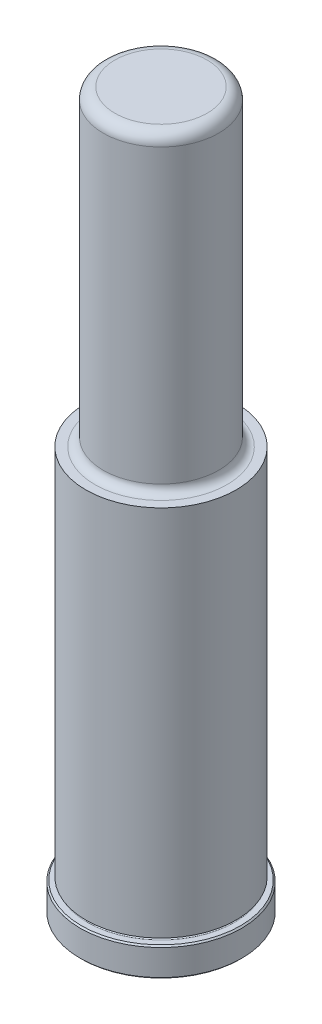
from build123d import *

# Parameters (mm, degrees)
CHAMFER1_SIZE = 0.381
FILLET7_R     = 3.175


with BuildPart() as part:
    # Sketch1 → Revolve1 (revolve)
    with BuildSketch(Plane(origin=(0, 0, 0), x_dir=(0, 0, -1), z_dir=(1, 0, 0)), mode=Mode.PRIVATE) as revolve1_sk:
        with BuildLine():
            Line((0, 0), (22.225, 0))
            Line((22.225, 0), (22.225, 7.9248))
            Line((22.225, 7.9248), (20.2438, 7.9248))
            ThreePointArc((20.2438, 7.9248), (19.8628, 8.3058), (20.2438, 8.6868))
            Line((20.2438, 8.6868), (20.6502, 8.6868))
            Line((20.6502, 8.6868), (20.6502, 111.125))
            Line((20.6502, 111.125), (18.1483, 111.125))
            ThreePointArc((18.1483, 111.125), (16.531853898, 111.794553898), (15.8623, 113.411))
            Line((15.8623, 113.411), (15.8623, 196.85))
            Line((15.8623, 196.85), (0, 196.85))
            Line((0, 196.85), (0, 0))
        make_face()
    revolve(revolve1_sk.sketch.rotate(Axis((0, 0, 0), (0, -1, 0)), 180), axis=Axis((0, 0, 0), (0, -1, 0)))

    # Chamfer1
    chamfer1_edges = [part.edges().sort_by_distance(p)[0] for p in [
        (0, 7.9248, -22.225),
        (0, 0, -22.225),
    ]]
    chamfer(chamfer1_edges, length=CHAMFER1_SIZE)

    # Fillet7
    fillet7_edges = [part.edges().sort_by_distance(p)[0] for p in [
        (0, 196.85, -15.8623),
    ]]
    fillet(fillet7_edges, radius=FILLET7_R)


solid = part.part
